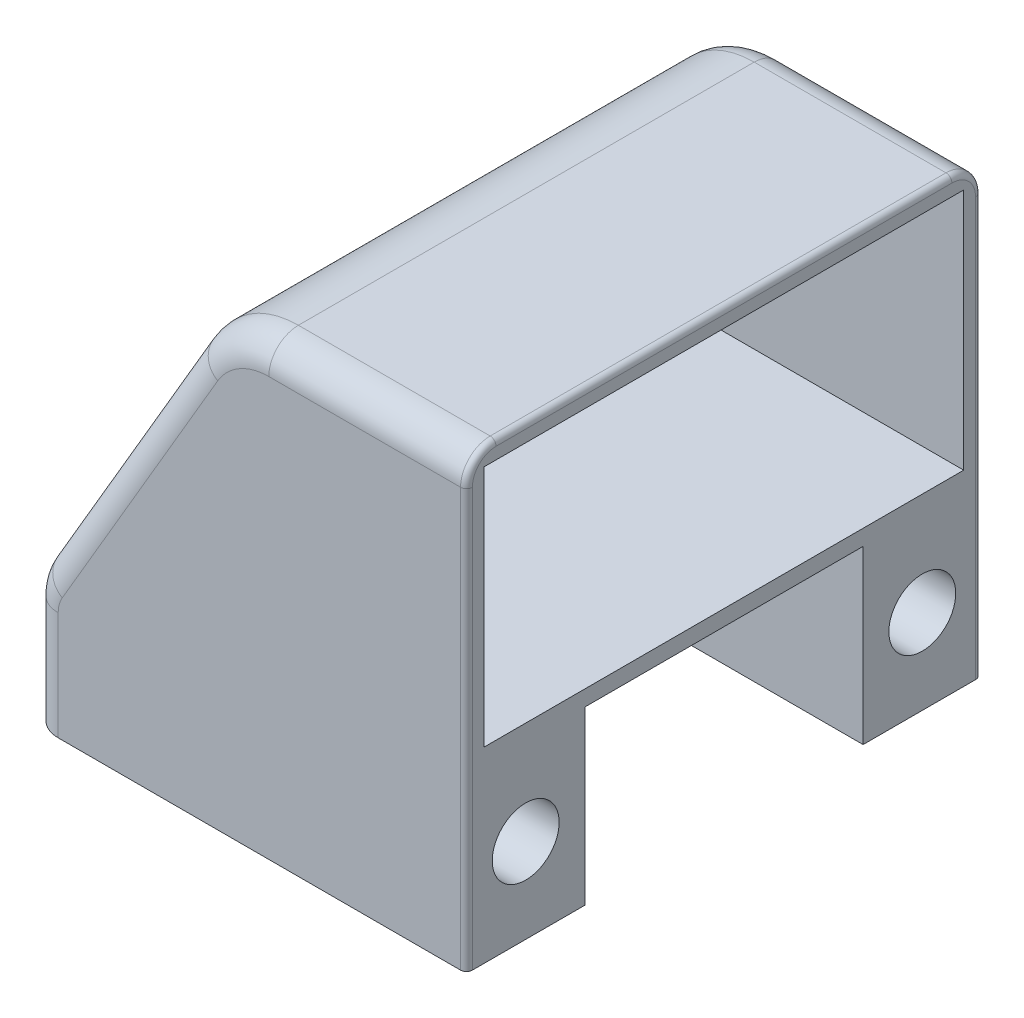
from build123d import *

# Parameters (mm, degrees)
BOSS_EXTRU_1_DEPTH      = 87
COQUE1_T                = -3
BOSS_EXTRU_2_START      = -87
BOSS_EXTRU_2_DEPTH      = 87
ESQUISSE3_W             = 47
ESQUISSE3_H             = 29
ENL_V_MAT_EXTRU_1_DEPTH = 49.5
ESQUISSE4_W             = 47
ESQUISSE4_H             = 26
ENL_V_MAT_EXTRU_2_DEPTH = 17.5
ESQUISSE5_R             = 5.65
ENL_V_MAT_EXTRU_3_DEPTH = 66.4
CONG_1_R                = 15
CONG_2_R                = 10
CONG_3_R                = 5
CONG_4_R                = 10
CONG_5_R                = 1


with BuildPart() as part:
    # Esquisse1 → Boss.-Extru.1 (new body)
    with BuildSketch(Plane.XY):
        Polygon((-42, 47), (-69.5, 0), (0, 0), (0, 47), align=None)
    extrude(amount=BOSS_EXTRU_1_DEPTH)

    # Coque1
    coque1_openings = [part.faces().sort_by_distance(p)[0] for p in [
        (0, 23.5, 43.5),
    ]]
    offset(amount=COQUE1_T, openings=coque1_openings, kind=Kind.INTERSECTION)

    # Esquisse2 → Boss.-Extru.2 (add)
    with BuildSketch(Plane.XY.offset(87).offset(BOSS_EXTRU_2_START)):
        Polygon((0, 0), (0, -7.65), (0, -28.65), (-73.97606383, -28.65), (-73.97606383, -7.65), (-69.5, 0), align=None)
    extrude(amount=BOSS_EXTRU_2_DEPTH)

    # Esquisse3 → Enl_v. mat.-Extru.1 (cut)
    with BuildSketch(Plane(origin=(0, 0, 0), x_dir=(0, 0, -1), z_dir=(1, 0, 0))):
        with Locations((-43.5, -14.15)):
            Rectangle(ESQUISSE3_W, ESQUISSE3_H)
    extrude(amount=-ENL_V_MAT_EXTRU_1_DEPTH, mode=Mode.SUBTRACT)

    # Esquisse4 → Enl_v. mat.-Extru.2 (cut)
    with BuildSketch(Plane(origin=(-49.5, 0, 0), x_dir=(0, 0, -1), z_dir=(1, 0, 0))):
        with Locations((-43.5, -12.65)):
            Rectangle(ESQUISSE4_W, ESQUISSE4_H)
    extrude(amount=-ENL_V_MAT_EXTRU_2_DEPTH, mode=Mode.SUBTRACT)

    # Esquisse5 → Enl_v. mat.-Extru.3 (cut)
    with BuildSketch(Plane(origin=(0, 0, 0), x_dir=(0, 0, -1), z_dir=(1, 0, 0))):
        with Locations((-77, -14.33)):
            Circle(ESQUISSE5_R)
        with Locations((-10, -14.33)):
            Circle(ESQUISSE5_R)
    extrude(amount=-ENL_V_MAT_EXTRU_3_DEPTH, mode=Mode.SUBTRACT)

    # Cong_1
    cong_1_edges = [part.edges().sort_by_distance(p)[0] for p in [
        (-42, 47, 43.5),
    ]]
    fillet(cong_1_edges, radius=CONG_1_R)

    # Cong_2
    cong_2_edges = [part.edges().sort_by_distance(p)[0] for p in [
        (-73.97606383, -7.65, 43.5),
    ]]
    fillet(cong_2_edges, radius=CONG_2_R)

    # Cong_3
    cong_3_edges = [part.edges().sort_by_distance(p)[0] for p in [
        (-73.97606383, -19.505292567, 0),
        (-16.698812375, 47, 0),
        (-16.698812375, 47, 87),
        (-59.47574543, 17.132362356, 0),
        (-59.47574543, 17.132362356, 87),
        (-40.859937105, 45.012067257, 0),
        (-40.859937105, 45.012067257, 87),
        (-73.97606383, -19.505292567, 87),
        (-73.62777894, -7.744405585, 87),
        (-73.62777894, -7.744405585, 0),
    ]]
    fillet(cong_3_edges, radius=CONG_3_R)

    # Cong_4
    cong_4_edges = [part.edges().sort_by_distance(p)[0] for p in [
        (-40.27952495, 44, 43.5),
    ]]
    fillet(cong_4_edges, radius=CONG_4_R)

    # Cong_5
    cong_5_edges = [part.edges().sort_by_distance(p)[0] for p in [
        (0, 6.675, 87),
        (0, 6.675, 0),
        (0, 47, 43.5),
        (0, 45.535533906, 85.535533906),
        (0, 45.535533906, 1.464466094),
    ]]
    fillet(cong_5_edges, radius=CONG_5_R)


solid = part.part
